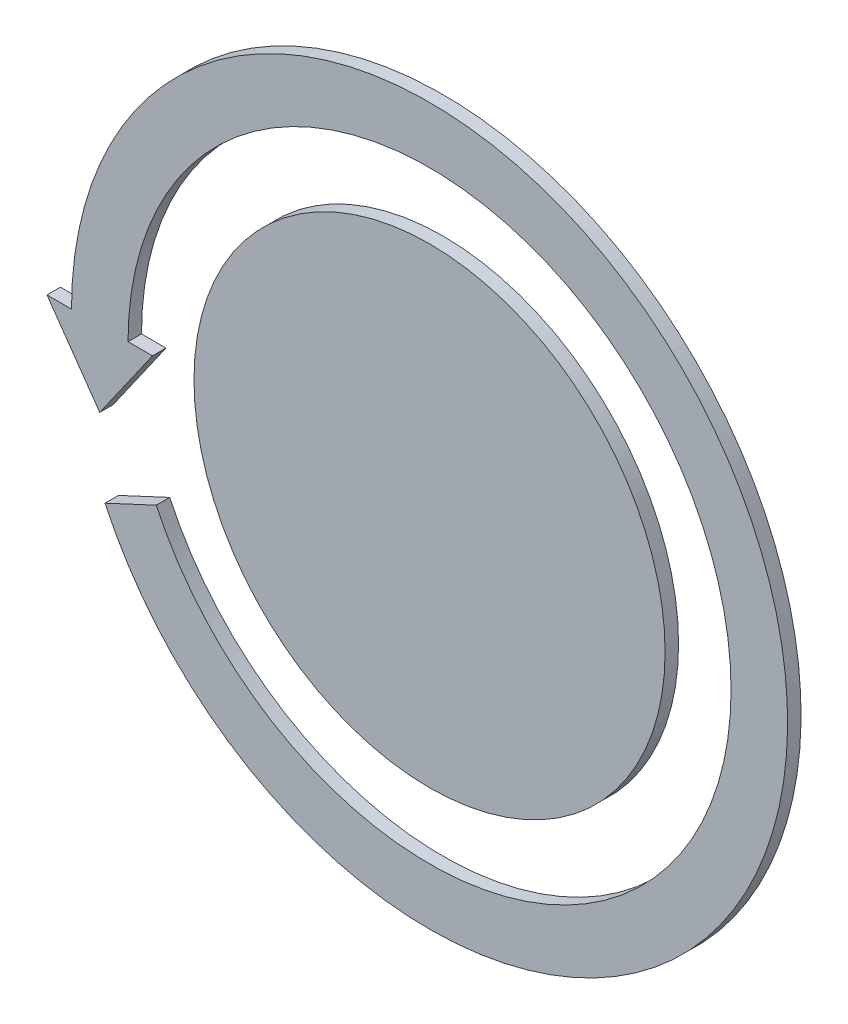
ISO-10303-21;
HEADER;
FILE_DESCRIPTION(('STEP AP214'),'2;1');
FILE_NAME('part.step','',(''),(''),'','','');
FILE_SCHEMA(('AUTOMOTIVE_DESIGN { 1 0 10303 214 1 1 1 1 }'));
ENDSEC;
DATA;
#1=APPLICATION_CONTEXT('core data for automotive mechanical design processes');
#2=APPLICATION_PROTOCOL_DEFINITION('international standard','automotive_design',2000,#1);
#3=PRODUCT_CONTEXT('',#1,'mechanical');
#4=PRODUCT('Part','Part','',(#3));
#5=PRODUCT_RELATED_PRODUCT_CATEGORY('part','',(#4));
#6=PRODUCT_DEFINITION_FORMATION('','',#4);
#7=PRODUCT_DEFINITION_CONTEXT('part definition',#1,'design');
#8=PRODUCT_DEFINITION('design','',#6,#7);
#9=PRODUCT_DEFINITION_SHAPE('','',#8);
#10=(LENGTH_UNIT() NAMED_UNIT(*) SI_UNIT(.MILLI.,.METRE.));
#11=(NAMED_UNIT(*) PLANE_ANGLE_UNIT() SI_UNIT($,.RADIAN.));
#12=(NAMED_UNIT(*) SI_UNIT($,.STERADIAN.) SOLID_ANGLE_UNIT());
#13=UNCERTAINTY_MEASURE_WITH_UNIT(LENGTH_MEASURE(1.E-05),#10,'distance_accuracy_value','');
#14=(GEOMETRIC_REPRESENTATION_CONTEXT(3) GLOBAL_UNCERTAINTY_ASSIGNED_CONTEXT((#13)) GLOBAL_UNIT_ASSIGNED_CONTEXT((#10,
#11,#12)) REPRESENTATION_CONTEXT('',''));
#15=CARTESIAN_POINT('',(0.,0.,0.));
#16=DIRECTION('',(0.,0.,1.));
#17=DIRECTION('',(1.,0.,0.));
#18=AXIS2_PLACEMENT_3D('',#15,#16,#17);
#19=CARTESIAN_POINT('',(-53.1948023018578,1.02511315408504E-13,2.));
#20=DIRECTION('',(0.,-1.,0.));
#21=DIRECTION('',(1.,0.,0.));
#22=AXIS2_PLACEMENT_3D('',#19,#20,#21);
#23=PLANE('',#22);
#24=DIRECTION('',(-1.,0.,0.));
#25=VECTOR('',#24,1.);
#26=CARTESIAN_POINT('',(-53.1948023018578,1.02511315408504E-13,0.));
#27=LINE('',#26,#25);
#28=CARTESIAN_POINT('',(-53.1948023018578,1.01007435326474E-13,0.));
#29=VERTEX_POINT('',#28);
#30=CARTESIAN_POINT('',(-56.8344116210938,1.02064082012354E-13,0.));
#31=VERTEX_POINT('',#30);
#32=EDGE_CURVE('E133',#29,#31,#27,.T.);
#33=ORIENTED_EDGE('',*,*,#32,.T.);
#34=DIRECTION('',(0.,0.,-1.));
#35=VECTOR('',#34,1.);
#36=CARTESIAN_POINT('',(-56.8344116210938,1.02064082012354E-13,2.));
#37=LINE('',#36,#35);
#38=CARTESIAN_POINT('',(-56.8344116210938,1.02064082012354E-13,2.));
#39=VERTEX_POINT('',#38);
#40=EDGE_CURVE('E12',#39,#31,#37,.T.);
#41=ORIENTED_EDGE('',*,*,#40,.F.);
#42=DIRECTION('',(-1.,0.,0.));
#43=VECTOR('',#42,1.);
#44=CARTESIAN_POINT('',(-53.1948023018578,1.02511315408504E-13,2.));
#45=LINE('',#44,#43);
#46=CARTESIAN_POINT('',(-53.1948023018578,1.01007435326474E-13,2.));
#47=VERTEX_POINT('',#46);
#48=EDGE_CURVE('E145',#47,#39,#45,.T.);
#49=ORIENTED_EDGE('',*,*,#48,.F.);
#50=DIRECTION('',(0.,0.,-1.));
#51=VECTOR('',#50,1.);
#52=CARTESIAN_POINT('',(-53.1948023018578,1.01007435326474E-13,2.));
#53=LINE('',#52,#51);
#54=EDGE_CURVE('E129',#47,#29,#53,.T.);
#55=ORIENTED_EDGE('',*,*,#54,.T.);
#56=EDGE_LOOP('',(#33,#41,#49,#55));
#57=FACE_BOUND('',#56,.T.);
#58=ADVANCED_FACE('F43',(#57),#23,.F.);
#59=CARTESIAN_POINT('',(-56.8344116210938,1.02064082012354E-13,2.));
#60=DIRECTION('',(0.819158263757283,0.573567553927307,0.));
#61=DIRECTION('',(-0.573567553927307,0.819158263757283,0.));
#62=AXIS2_PLACEMENT_3D('',#59,#60,#61);
#63=PLANE('',#62);
#64=DIRECTION('',(0.573567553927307,-0.819158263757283,0.));
#65=VECTOR('',#64,1.);
#66=CARTESIAN_POINT('',(-56.8344116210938,1.02064082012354E-13,0.));
#67=LINE('',#66,#65);
#68=CARTESIAN_POINT('',(-48.995361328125,-11.1955824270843,0.));
#69=VERTEX_POINT('',#68);
#70=EDGE_CURVE('E136',#31,#69,#67,.T.);
#71=ORIENTED_EDGE('',*,*,#70,.T.);
#72=DIRECTION('',(0.,0.,-1.));
#73=VECTOR('',#72,1.);
#74=CARTESIAN_POINT('',(-48.995361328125,-11.1955824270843,2.));
#75=LINE('',#74,#73);
#76=CARTESIAN_POINT('',(-48.995361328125,-11.1955824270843,2.));
#77=VERTEX_POINT('',#76);
#78=EDGE_CURVE('E51',#77,#69,#75,.T.);
#79=ORIENTED_EDGE('',*,*,#78,.F.);
#80=DIRECTION('',(0.573567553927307,-0.819158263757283,0.));
#81=VECTOR('',#80,1.);
#82=CARTESIAN_POINT('',(-56.8344116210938,1.02064082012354E-13,2.));
#83=LINE('',#82,#81);
#84=EDGE_CURVE('E99',#39,#77,#83,.T.);
#85=ORIENTED_EDGE('',*,*,#84,.F.);
#86=ORIENTED_EDGE('',*,*,#40,.T.);
#87=EDGE_LOOP('',(#71,#79,#85,#86));
#88=FACE_BOUND('',#87,.T.);
#89=ADVANCED_FACE('F170',(#88),#63,.F.);
#90=CARTESIAN_POINT('',(-48.995361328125,-11.1955824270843,2.));
#91=DIRECTION('',(-0.81914777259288,0.573582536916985,0.));
#92=DIRECTION('',(-0.573582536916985,-0.81914777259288,0.));
#93=AXIS2_PLACEMENT_3D('',#90,#91,#92);
#94=PLANE('',#93);
#95=DIRECTION('',(0.573582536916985,0.81914777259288,0.));
#96=VECTOR('',#95,1.);
#97=CARTESIAN_POINT('',(-48.995361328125,-11.1955824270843,0.));
#98=LINE('',#97,#96);
#99=CARTESIAN_POINT('',(-41.1560058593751,1.03988540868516E-13,0.));
#100=VERTEX_POINT('',#99);
#101=EDGE_CURVE('E138',#69,#100,#98,.T.);
#102=ORIENTED_EDGE('',*,*,#101,.T.);
#103=DIRECTION('',(0.,0.,-1.));
#104=VECTOR('',#103,1.);
#105=CARTESIAN_POINT('',(-41.1560058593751,1.03988540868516E-13,2.));
#106=LINE('',#105,#104);
#107=CARTESIAN_POINT('',(-41.1560058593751,1.03988540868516E-13,2.));
#108=VERTEX_POINT('',#107);
#109=EDGE_CURVE('E149',#108,#100,#106,.T.);
#110=ORIENTED_EDGE('',*,*,#109,.F.);
#111=DIRECTION('',(0.573582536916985,0.81914777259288,0.));
#112=VECTOR('',#111,1.);
#113=CARTESIAN_POINT('',(-48.995361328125,-11.1955824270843,2.));
#114=LINE('',#113,#112);
#115=EDGE_CURVE('E157',#77,#108,#114,.T.);
#116=ORIENTED_EDGE('',*,*,#115,.F.);
#117=ORIENTED_EDGE('',*,*,#78,.T.);
#118=EDGE_LOOP('',(#102,#110,#116,#117));
#119=FACE_BOUND('',#118,.T.);
#120=ADVANCED_FACE('F155',(#119),#94,.F.);
#121=CARTESIAN_POINT('',(-41.1560058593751,1.03988540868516E-13,2.));
#122=DIRECTION('',(0.,-1.,0.));
#123=DIRECTION('',(1.,0.,0.));
#124=AXIS2_PLACEMENT_3D('',#121,#122,#123);
#125=PLANE('',#124);
#126=DIRECTION('',(-1.,0.,0.));
#127=VECTOR('',#126,1.);
#128=CARTESIAN_POINT('',(-41.1560058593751,1.03988540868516E-13,0.));
#129=LINE('',#128,#127);
#130=CARTESIAN_POINT('',(-44.7956668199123,0.,0.));
#131=VERTEX_POINT('',#130);
#132=EDGE_CURVE('E140',#100,#131,#129,.T.);
#133=ORIENTED_EDGE('',*,*,#132,.T.);
#134=DIRECTION('',(0.,0.,-1.));
#135=VECTOR('',#134,1.);
#136=CARTESIAN_POINT('',(-44.7956668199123,0.,2.));
#137=LINE('',#136,#135);
#138=CARTESIAN_POINT('',(-44.7956668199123,0.,2.));
#139=VERTEX_POINT('',#138);
#140=EDGE_CURVE('E124',#139,#131,#137,.T.);
#141=ORIENTED_EDGE('',*,*,#140,.F.);
#142=DIRECTION('',(-1.,0.,0.));
#143=VECTOR('',#142,1.);
#144=CARTESIAN_POINT('',(-41.1560058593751,1.03988540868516E-13,2.));
#145=LINE('',#144,#143);
#146=EDGE_CURVE('E115',#108,#139,#145,.T.);
#147=ORIENTED_EDGE('',*,*,#146,.F.);
#148=ORIENTED_EDGE('',*,*,#109,.T.);
#149=EDGE_LOOP('',(#133,#141,#147,#148));
#150=FACE_BOUND('',#149,.T.);
#151=ADVANCED_FACE('F163',(#150),#125,.F.);
#152=CARTESIAN_POINT('',(0.,0.,2.));
#153=DIRECTION('',(0.,0.,-1.));
#154=DIRECTION('',(-1.,0.,0.));
#155=AXIS2_PLACEMENT_3D('',#152,#153,#154);
#156=CYLINDRICAL_SURFACE('',#155,44.7956668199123);
#157=CARTESIAN_POINT('',(0.,0.,0.));
#158=DIRECTION('',(0.,0.,-1.));
#159=DIRECTION('',(1.,0.,0.));
#160=AXIS2_PLACEMENT_3D('',#157,#158,#159);
#161=CIRCLE('',#160,44.7956668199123);
#162=CARTESIAN_POINT('',(-40.5986616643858,-18.9314668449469,0.));
#163=VERTEX_POINT('',#162);
#164=EDGE_CURVE('E123',#131,#163,#161,.T.);
#165=ORIENTED_EDGE('',*,*,#164,.T.);
#166=DIRECTION('',(0.,0.,-1.));
#167=VECTOR('',#166,1.);
#168=CARTESIAN_POINT('',(-40.5986616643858,-18.9314668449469,2.));
#169=LINE('',#168,#167);
#170=CARTESIAN_POINT('',(-40.5986616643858,-18.9314668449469,2.));
#171=VERTEX_POINT('',#170);
#172=EDGE_CURVE('E120',#171,#163,#169,.T.);
#173=ORIENTED_EDGE('',*,*,#172,.F.);
#174=CARTESIAN_POINT('',(0.,0.,2.));
#175=DIRECTION('',(0.,0.,-1.));
#176=DIRECTION('',(1.,0.,0.));
#177=AXIS2_PLACEMENT_3D('',#174,#175,#176);
#178=CIRCLE('',#177,44.7956668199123);
#179=EDGE_CURVE('E109',#139,#171,#178,.T.);
#180=ORIENTED_EDGE('',*,*,#179,.F.);
#181=ORIENTED_EDGE('',*,*,#140,.T.);
#182=EDGE_LOOP('',(#165,#173,#180,#181));
#183=FACE_BOUND('',#182,.T.);
#184=ADVANCED_FACE('F121',(#183),#156,.F.);
#185=CARTESIAN_POINT('',(-40.5986616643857,-18.9314668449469,2.));
#186=DIRECTION('',(0.422618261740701,-0.906307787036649,0.));
#187=DIRECTION('',(0.906307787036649,0.422618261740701,0.));
#188=AXIS2_PLACEMENT_3D('',#185,#186,#187);
#189=PLANE('',#188);
#190=DIRECTION('',(-0.906307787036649,-0.422618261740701,0.));
#191=VECTOR('',#190,1.);
#192=CARTESIAN_POINT('',(-40.5986616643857,-18.9314668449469,0.));
#193=LINE('',#192,#191);
#194=CARTESIAN_POINT('',(-48.2108635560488,-22.4810948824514,0.));
#195=VERTEX_POINT('',#194);
#196=EDGE_CURVE('E85',#163,#195,#193,.T.);
#197=ORIENTED_EDGE('',*,*,#196,.T.);
#198=DIRECTION('',(0.,0.,-1.));
#199=VECTOR('',#198,1.);
#200=CARTESIAN_POINT('',(-48.2108635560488,-22.4810948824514,2.));
#201=LINE('',#200,#199);
#202=CARTESIAN_POINT('',(-48.2108635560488,-22.4810948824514,2.));
#203=VERTEX_POINT('',#202);
#204=EDGE_CURVE('E125',#203,#195,#201,.T.);
#205=ORIENTED_EDGE('',*,*,#204,.F.);
#206=DIRECTION('',(-0.906307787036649,-0.422618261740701,0.));
#207=VECTOR('',#206,1.);
#208=CARTESIAN_POINT('',(-40.5986616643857,-18.9314668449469,2.));
#209=LINE('',#208,#207);
#210=EDGE_CURVE('E113',#171,#203,#209,.T.);
#211=ORIENTED_EDGE('',*,*,#210,.F.);
#212=ORIENTED_EDGE('',*,*,#172,.T.);
#213=EDGE_LOOP('',(#197,#205,#211,#212));
#214=FACE_BOUND('',#213,.T.);
#215=ADVANCED_FACE('F127',(#214),#189,.F.);
#216=CARTESIAN_POINT('',(0.,0.,2.));
#217=DIRECTION('',(0.,0.,-1.));
#218=DIRECTION('',(-1.,0.,0.));
#219=AXIS2_PLACEMENT_3D('',#216,#217,#218);
#220=CYLINDRICAL_SURFACE('',#219,53.1948023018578);
#221=CARTESIAN_POINT('',(0.,0.,0.));
#222=DIRECTION('',(0.,0.,1.));
#223=DIRECTION('',(1.,0.,0.));
#224=AXIS2_PLACEMENT_3D('',#221,#222,#223);
#225=CIRCLE('',#224,53.1948023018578);
#226=EDGE_CURVE('E91',#195,#29,#225,.T.);
#227=ORIENTED_EDGE('',*,*,#226,.T.);
#228=ORIENTED_EDGE('',*,*,#54,.F.);
#229=CARTESIAN_POINT('',(0.,0.,2.));
#230=DIRECTION('',(0.,0.,1.));
#231=DIRECTION('',(1.,0.,0.));
#232=AXIS2_PLACEMENT_3D('',#229,#230,#231);
#233=CIRCLE('',#232,53.1948023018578);
#234=EDGE_CURVE('E59',#203,#47,#233,.T.);
#235=ORIENTED_EDGE('',*,*,#234,.F.);
#236=ORIENTED_EDGE('',*,*,#204,.T.);
#237=EDGE_LOOP('',(#227,#228,#235,#236));
#238=FACE_BOUND('',#237,.T.);
#239=ADVANCED_FACE('F184',(#238),#220,.T.);
#240=CARTESIAN_POINT('',(0.,0.,2.));
#241=DIRECTION('',(0.,0.,1.));
#242=DIRECTION('',(1.,0.,0.));
#243=AXIS2_PLACEMENT_3D('',#240,#241,#242);
#244=PLANE('',#243);
#245=ORIENTED_EDGE('',*,*,#48,.T.);
#246=ORIENTED_EDGE('',*,*,#84,.T.);
#247=ORIENTED_EDGE('',*,*,#115,.T.);
#248=ORIENTED_EDGE('',*,*,#146,.T.);
#249=ORIENTED_EDGE('',*,*,#179,.T.);
#250=ORIENTED_EDGE('',*,*,#210,.T.);
#251=ORIENTED_EDGE('',*,*,#234,.T.);
#252=EDGE_LOOP('',(#245,#246,#247,#248,#249,#250,#251));
#253=FACE_BOUND('',#252,.T.);
#254=ADVANCED_FACE('F111',(#253),#244,.T.);
#255=CARTESIAN_POINT('',(0.,0.,0.));
#256=DIRECTION('',(0.,0.,1.));
#257=DIRECTION('',(1.,0.,0.));
#258=AXIS2_PLACEMENT_3D('',#255,#256,#257);
#259=PLANE('',#258);
#260=ORIENTED_EDGE('',*,*,#32,.F.);
#261=ORIENTED_EDGE('',*,*,#226,.F.);
#262=ORIENTED_EDGE('',*,*,#196,.F.);
#263=ORIENTED_EDGE('',*,*,#164,.F.);
#264=ORIENTED_EDGE('',*,*,#132,.F.);
#265=ORIENTED_EDGE('',*,*,#101,.F.);
#266=ORIENTED_EDGE('',*,*,#70,.F.);
#267=EDGE_LOOP('',(#260,#261,#262,#263,#264,#265,#266));
#268=FACE_BOUND('',#267,.T.);
#269=ADVANCED_FACE('F161',(#268),#259,.F.);
#270=CLOSED_SHELL('',(#58,#89,#120,#151,#184,#215,#239,#254,#269));
#271=MANIFOLD_SOLID_BREP('B2',#270);
#272=CARTESIAN_POINT('',(0.,0.,2.));
#273=DIRECTION('',(0.,0.,-1.));
#274=DIRECTION('',(-1.,0.,0.));
#275=AXIS2_PLACEMENT_3D('',#272,#273,#274);
#276=CYLINDRICAL_SURFACE('',#275,34.9965925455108);
#277=CARTESIAN_POINT('',(0.,0.,2.));
#278=DIRECTION('',(0.,0.,1.));
#279=DIRECTION('',(1.,0.,0.));
#280=AXIS2_PLACEMENT_3D('',#277,#278,#279);
#281=CIRCLE('',#280,34.9965925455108);
#282=CARTESIAN_POINT('',(34.9965925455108,0.,2.));
#283=VERTEX_POINT('',#282);
#284=EDGE_CURVE('E42',#283,#283,#281,.T.);
#285=ORIENTED_EDGE('',*,*,#284,.F.);
#286=EDGE_LOOP('',(#285));
#287=FACE_BOUND('',#286,.T.);
#288=CARTESIAN_POINT('',(0.,0.,0.));
#289=DIRECTION('',(0.,0.,1.));
#290=DIRECTION('',(1.,0.,0.));
#291=AXIS2_PLACEMENT_3D('',#288,#289,#290);
#292=CIRCLE('',#291,34.9965925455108);
#293=CARTESIAN_POINT('',(34.9965925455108,0.,0.));
#294=VERTEX_POINT('',#293);
#295=EDGE_CURVE('E248',#294,#294,#292,.T.);
#296=ORIENTED_EDGE('',*,*,#295,.T.);
#297=EDGE_LOOP('',(#296));
#298=FACE_BOUND('',#297,.T.);
#299=ADVANCED_FACE('F245',(#287,#298),#276,.T.);
#300=CARTESIAN_POINT('',(0.,0.,2.));
#301=DIRECTION('',(0.,0.,1.));
#302=DIRECTION('',(1.,0.,0.));
#303=AXIS2_PLACEMENT_3D('',#300,#301,#302);
#304=PLANE('',#303);
#305=ORIENTED_EDGE('',*,*,#284,.T.);
#306=EDGE_LOOP('',(#305));
#307=FACE_BOUND('',#306,.T.);
#308=ADVANCED_FACE('F260',(#307),#304,.T.);
#309=CARTESIAN_POINT('',(0.,0.,0.));
#310=DIRECTION('',(0.,0.,1.));
#311=DIRECTION('',(1.,0.,0.));
#312=AXIS2_PLACEMENT_3D('',#309,#310,#311);
#313=PLANE('',#312);
#314=ORIENTED_EDGE('',*,*,#295,.F.);
#315=EDGE_LOOP('',(#314));
#316=FACE_BOUND('',#315,.T.);
#317=ADVANCED_FACE('F258',(#316),#313,.F.);
#318=CLOSED_SHELL('',(#299,#308,#317));
#319=MANIFOLD_SOLID_BREP('B6',#318);
#320=ADVANCED_BREP_SHAPE_REPRESENTATION('',(#18,#271,#319),#14);
#321=SHAPE_DEFINITION_REPRESENTATION(#9,#320);
ENDSEC;
END-ISO-10303-21;
